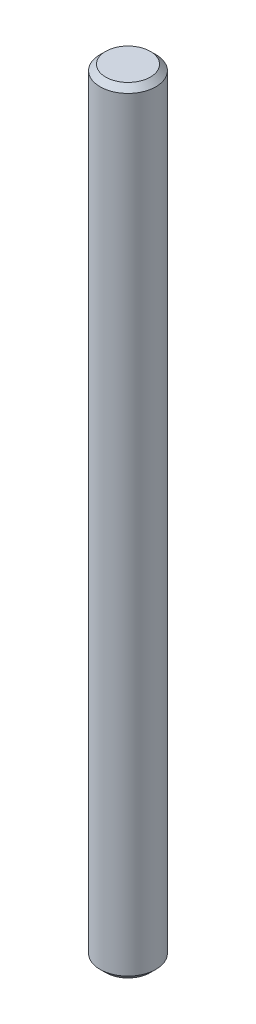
ISO-10303-21;
HEADER;
FILE_DESCRIPTION(('STEP AP214'),'2;1');
FILE_NAME('part.step','',(''),(''),'','','');
FILE_SCHEMA(('AUTOMOTIVE_DESIGN { 1 0 10303 214 1 1 1 1 }'));
ENDSEC;
DATA;
#1=APPLICATION_CONTEXT('core data for automotive mechanical design processes');
#2=APPLICATION_PROTOCOL_DEFINITION('international standard','automotive_design',2000,#1);
#3=PRODUCT_CONTEXT('',#1,'mechanical');
#4=PRODUCT('Part','Part','',(#3));
#5=PRODUCT_RELATED_PRODUCT_CATEGORY('part','',(#4));
#6=PRODUCT_DEFINITION_FORMATION('','',#4);
#7=PRODUCT_DEFINITION_CONTEXT('part definition',#1,'design');
#8=PRODUCT_DEFINITION('design','',#6,#7);
#9=PRODUCT_DEFINITION_SHAPE('','',#8);
#10=(LENGTH_UNIT() NAMED_UNIT(*) SI_UNIT(.MILLI.,.METRE.));
#11=(NAMED_UNIT(*) PLANE_ANGLE_UNIT() SI_UNIT($,.RADIAN.));
#12=(NAMED_UNIT(*) SI_UNIT($,.STERADIAN.) SOLID_ANGLE_UNIT());
#13=UNCERTAINTY_MEASURE_WITH_UNIT(LENGTH_MEASURE(1.E-05),#10,'distance_accuracy_value','');
#14=(GEOMETRIC_REPRESENTATION_CONTEXT(3) GLOBAL_UNCERTAINTY_ASSIGNED_CONTEXT((#13)) GLOBAL_UNIT_ASSIGNED_CONTEXT((#10,
#11,#12)) REPRESENTATION_CONTEXT('',''));
#15=CARTESIAN_POINT('',(0.,0.,0.));
#16=DIRECTION('',(0.,0.,1.));
#17=DIRECTION('',(1.,0.,0.));
#18=AXIS2_PLACEMENT_3D('',#15,#16,#17);
#19=CARTESIAN_POINT('',(0.,69.5,0.));
#20=DIRECTION('',(0.,-1.,0.));
#21=DIRECTION('',(0.,0.,-1.));
#22=AXIS2_PLACEMENT_3D('',#19,#20,#21);
#23=CYLINDRICAL_SURFACE('',#22,5.);
#24=CARTESIAN_POINT('',(0.,68.5,0.));
#25=DIRECTION('',(0.,1.,0.));
#26=DIRECTION('',(0.,0.,1.));
#27=AXIS2_PLACEMENT_3D('',#24,#25,#26);
#28=CIRCLE('',#27,5.);
#29=CARTESIAN_POINT('',(0.,68.5,5.));
#30=VERTEX_POINT('',#29);
#31=EDGE_CURVE('E42',#30,#30,#28,.F.);
#32=ORIENTED_EDGE('',*,*,#31,.T.);
#33=EDGE_LOOP('',(#32));
#34=FACE_BOUND('',#33,.T.);
#35=CARTESIAN_POINT('',(0.,-68.5,0.));
#36=DIRECTION('',(0.,1.,0.));
#37=DIRECTION('',(0.,0.,1.));
#38=AXIS2_PLACEMENT_3D('',#35,#36,#37);
#39=CIRCLE('',#38,5.);
#40=CARTESIAN_POINT('',(0.,-68.5,5.));
#41=VERTEX_POINT('',#40);
#42=EDGE_CURVE('E46',#41,#41,#39,.T.);
#43=ORIENTED_EDGE('',*,*,#42,.T.);
#44=EDGE_LOOP('',(#43));
#45=FACE_BOUND('',#44,.T.);
#46=ADVANCED_FACE('F35',(#34,#45),#23,.T.);
#47=CARTESIAN_POINT('',(0.,69.5,0.));
#48=DIRECTION('',(0.,1.,0.));
#49=DIRECTION('',(0.,0.,1.));
#50=AXIS2_PLACEMENT_3D('',#47,#48,#49);
#51=PLANE('',#50);
#52=CARTESIAN_POINT('',(0.,69.5,0.));
#53=DIRECTION('',(0.,1.,0.));
#54=DIRECTION('',(0.,0.,1.));
#55=AXIS2_PLACEMENT_3D('',#52,#53,#54);
#56=CIRCLE('',#55,4.00000000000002);
#57=CARTESIAN_POINT('',(0.,69.5,4.00000000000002));
#58=VERTEX_POINT('',#57);
#59=EDGE_CURVE('E50',#58,#58,#56,.T.);
#60=ORIENTED_EDGE('',*,*,#59,.T.);
#61=EDGE_LOOP('',(#60));
#62=FACE_BOUND('',#61,.T.);
#63=ADVANCED_FACE('F56',(#62),#51,.T.);
#64=CARTESIAN_POINT('',(0.,-69.5,0.));
#65=DIRECTION('',(0.,1.,0.));
#66=DIRECTION('',(0.,0.,1.));
#67=AXIS2_PLACEMENT_3D('',#64,#65,#66);
#68=PLANE('',#67);
#69=CARTESIAN_POINT('',(0.,-69.5,0.));
#70=DIRECTION('',(0.,1.,0.));
#71=DIRECTION('',(0.,0.,1.));
#72=AXIS2_PLACEMENT_3D('',#69,#70,#71);
#73=CIRCLE('',#72,4.);
#74=CARTESIAN_POINT('',(0.,-69.5,4.));
#75=VERTEX_POINT('',#74);
#76=EDGE_CURVE('E10',#75,#75,#73,.F.);
#77=ORIENTED_EDGE('',*,*,#76,.T.);
#78=EDGE_LOOP('',(#77));
#79=FACE_BOUND('',#78,.T.);
#80=ADVANCED_FACE('F60',(#79),#68,.F.);
#81=CARTESIAN_POINT('',(0.,69.5,0.));
#82=DIRECTION('',(0.,-1.,0.));
#83=DIRECTION('',(0.,0.,-1.));
#84=AXIS2_PLACEMENT_3D('',#81,#82,#83);
#85=CONICAL_SURFACE('',#84,4.00000000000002,0.785398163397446);
#86=ORIENTED_EDGE('',*,*,#31,.F.);
#87=EDGE_LOOP('',(#86));
#88=FACE_BOUND('',#87,.T.);
#89=ORIENTED_EDGE('',*,*,#59,.F.);
#90=EDGE_LOOP('',(#89));
#91=FACE_BOUND('',#90,.T.);
#92=ADVANCED_FACE('F58',(#88,#91),#85,.T.);
#93=CARTESIAN_POINT('',(0.,-68.5,0.));
#94=DIRECTION('',(0.,1.,0.));
#95=DIRECTION('',(0.,0.,1.));
#96=AXIS2_PLACEMENT_3D('',#93,#94,#95);
#97=CONICAL_SURFACE('',#96,5.,0.785398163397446);
#98=ORIENTED_EDGE('',*,*,#76,.F.);
#99=EDGE_LOOP('',(#98));
#100=FACE_BOUND('',#99,.T.);
#101=ORIENTED_EDGE('',*,*,#42,.F.);
#102=EDGE_LOOP('',(#101));
#103=FACE_BOUND('',#102,.T.);
#104=ADVANCED_FACE('F37',(#100,#103),#97,.T.);
#105=CLOSED_SHELL('',(#46,#63,#80,#92,#104));
#106=MANIFOLD_SOLID_BREP('B2',#105);
#107=ADVANCED_BREP_SHAPE_REPRESENTATION('',(#18,#106),#14);
#108=SHAPE_DEFINITION_REPRESENTATION(#9,#107);
ENDSEC;
END-ISO-10303-21;
